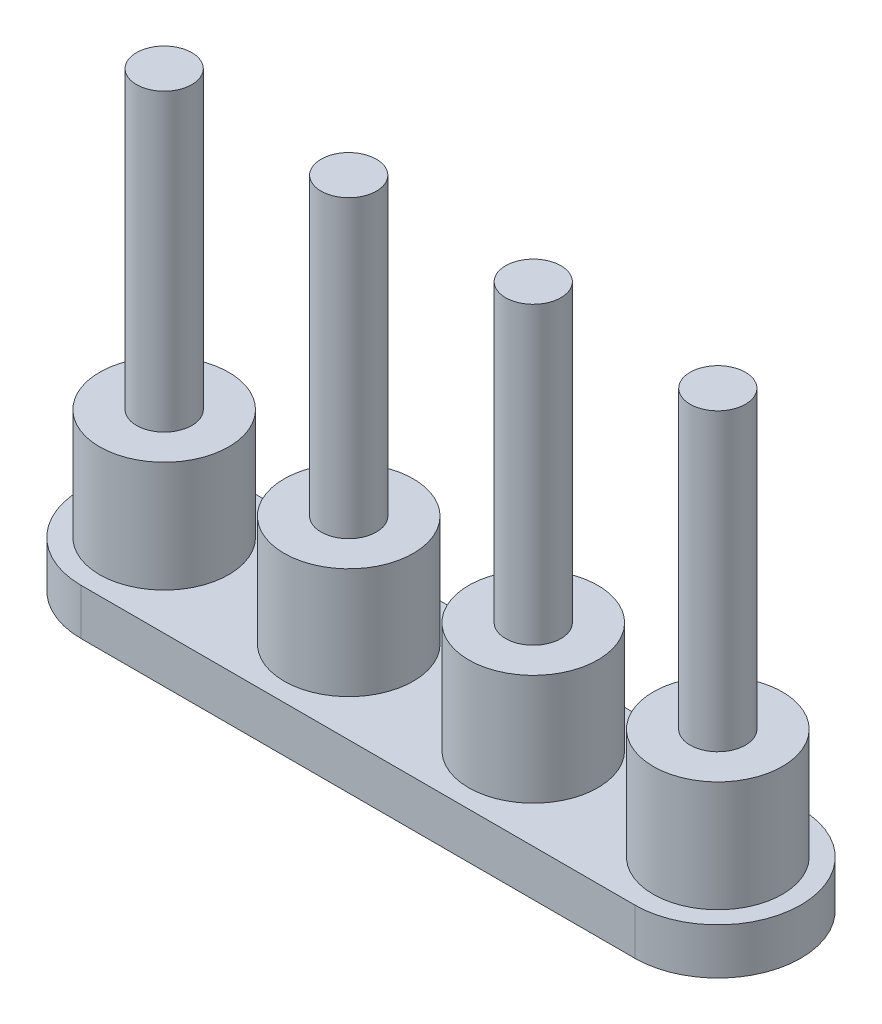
from build123d import *

# Parameters (mm, degrees)
EXTRUSION1_DEPTH  = 2.5
ESQUISSE2_R       = 3.5
EXTRUSION2_DEPTH  = 6
ESQUISSE3_R       = 3.5
EXTRUSION3_DEPTH  = 6
ESQUISSE4_R       = 3.5
EXTRUSION4_DEPTH  = 6
ESQUISSE5_R       = 3.5
EXTRUSION5_DEPTH  = 6
ESQUISSE7_R       = 1.5
EXTRUSION7_DEPTH  = 16
ESQUISSE8_R       = 1.5
EXTRUSION8_DEPTH  = 16
ESQUISSE9_R       = 1.5
EXTRUSION9_DEPTH  = 16
EXTRUSION13_DEPTH = 2.5
ESQUISSE14_R      = 1.5
EXTRUSION14_DEPTH = 16


with BuildPart() as part:
    # Esquisse1 → Extrusion1 (new body)
    with BuildSketch(Plane(origin=(0, 0, 0), x_dir=(1, 0, 0), z_dir=(0, 1, 0))):
        with BuildLine():
            Line((-15, 4.5), (15, 4.5))
            ThreePointArc((15, 4.5), (19.5, 0), (15, -4.5))
            Line((15, -4.5), (-15, -4.5))
            ThreePointArc((-15, -4.5), (-19.5, 0), (-15, 4.5))
        make_face()
    extrude(amount=EXTRUSION1_DEPTH)

    # Esquisse2 → Extrusion2 (add)
    with BuildSketch(Plane(origin=(0, 2.5, 0), x_dir=(-1, 0, 0), z_dir=(0, 1, 0))):
        with Locations(Location((-15, 0, 0), (0, 0, 90))):
            Circle(ESQUISSE2_R)
    extrude(amount=EXTRUSION2_DEPTH)

    # Esquisse3 → Extrusion3 (add)
    with BuildSketch(Plane(origin=(0, 2.5, 0), x_dir=(-1, 0, 0), z_dir=(0, 1, 0))):
        with Locations(Location((15, 0, 0), (0, 0, 90))):
            Circle(ESQUISSE3_R)
    extrude(amount=EXTRUSION3_DEPTH)

    # Esquisse4 → Extrusion4 (add)
    with BuildSketch(Plane(origin=(0, 2.5, 0), x_dir=(-1, 0, 0), z_dir=(0, 1, 0))):
        with Locations(Location((-5, 0, 0), (0, 0, 90))):
            Circle(ESQUISSE4_R)
    extrude(amount=EXTRUSION4_DEPTH)

    # Esquisse5 → Extrusion5 (add)
    with BuildSketch(Plane(origin=(0, 2.5, 0), x_dir=(-1, 0, 0), z_dir=(0, 1, 0))):
        with Locations(Location((5, 0, 0), (0, 0, 90))):
            Circle(ESQUISSE5_R)
    extrude(amount=EXTRUSION5_DEPTH)

    # Esquisse7 → Extrusion7 (add)
    with BuildSketch(Plane(origin=(0, 8.5, 0), x_dir=(-1, 0, 0), z_dir=(0, 1, 0))):
        with Locations(Location((-5, 0, 0), (0, 0, 90))):
            Circle(ESQUISSE7_R)
    extrude(amount=EXTRUSION7_DEPTH)

    # Esquisse8 → Extrusion8 (add)
    with BuildSketch(Plane(origin=(0, 8.5, 0), x_dir=(-1, 0, 0), z_dir=(0, 1, 0))):
        with Locations(Location((5, 0, 0), (0, 0, 90))):
            Circle(ESQUISSE8_R)
    extrude(amount=EXTRUSION8_DEPTH)

    # Esquisse9 → Extrusion9 (add)
    with BuildSketch(Plane(origin=(0, 8.5, 0), x_dir=(-1, 0, 0), z_dir=(0, 1, 0))):
        with Locations(Location((15, 0, 0), (0, 0, 90))):
            Circle(ESQUISSE9_R)
    extrude(amount=EXTRUSION9_DEPTH)

    # Esquisse13 → Extrusion13 (add)
    with BuildSketch(Plane.XZ):
        with BuildLine():
            Line((2.999980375, -4.5), (-2.999980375, -4.5))
            ThreePointArc((-2.999980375, -4.5), (0, -7.510851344), (2.999980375, -4.5))
        make_face()
    extrude(amount=-EXTRUSION13_DEPTH)

    # Esquisse14 → Extrusion14 (add)
    with BuildSketch(Plane(origin=(0, 8.5, 0), x_dir=(-1, 0, 0), z_dir=(0, 1, 0))):
        with Locations(Location((-15, 0, 0), (0, 0, 90))):
            Circle(ESQUISSE14_R)
    extrude(amount=EXTRUSION14_DEPTH)


solid = part.part
